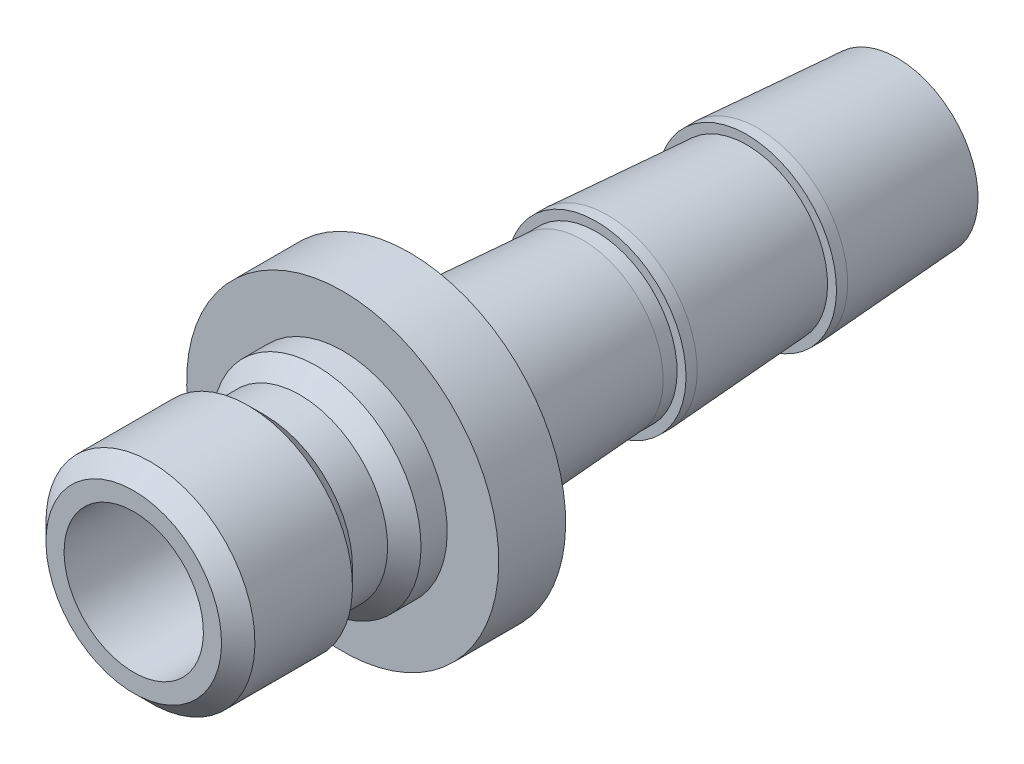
ISO-10303-21;
HEADER;
FILE_DESCRIPTION(('STEP AP214'),'2;1');
FILE_NAME('part.step','',(''),(''),'','','');
FILE_SCHEMA(('AUTOMOTIVE_DESIGN { 1 0 10303 214 1 1 1 1 }'));
ENDSEC;
DATA;
#1=APPLICATION_CONTEXT('core data for automotive mechanical design processes');
#2=APPLICATION_PROTOCOL_DEFINITION('international standard','automotive_design',2000,#1);
#3=PRODUCT_CONTEXT('',#1,'mechanical');
#4=PRODUCT('Part','Part','',(#3));
#5=PRODUCT_RELATED_PRODUCT_CATEGORY('part','',(#4));
#6=PRODUCT_DEFINITION_FORMATION('','',#4);
#7=PRODUCT_DEFINITION_CONTEXT('part definition',#1,'design');
#8=PRODUCT_DEFINITION('design','',#6,#7);
#9=PRODUCT_DEFINITION_SHAPE('','',#8);
#10=(LENGTH_UNIT() NAMED_UNIT(*) SI_UNIT(.MILLI.,.METRE.));
#11=(NAMED_UNIT(*) PLANE_ANGLE_UNIT() SI_UNIT($,.RADIAN.));
#12=(NAMED_UNIT(*) SI_UNIT($,.STERADIAN.) SOLID_ANGLE_UNIT());
#13=UNCERTAINTY_MEASURE_WITH_UNIT(LENGTH_MEASURE(1.E-05),#10,'distance_accuracy_value','');
#14=(GEOMETRIC_REPRESENTATION_CONTEXT(3) GLOBAL_UNCERTAINTY_ASSIGNED_CONTEXT((#13)) GLOBAL_UNIT_ASSIGNED_CONTEXT((#10,
#11,#12)) REPRESENTATION_CONTEXT('',''));
#15=CARTESIAN_POINT('',(0.,0.,0.));
#16=DIRECTION('',(0.,0.,1.));
#17=DIRECTION('',(1.,0.,0.));
#18=AXIS2_PLACEMENT_3D('',#15,#16,#17);
#19=CARTESIAN_POINT('',(0.,0.,0.));
#20=DIRECTION('',(0.,0.,-1.));
#21=DIRECTION('',(0.,1.,0.));
#22=AXIS2_PLACEMENT_3D('',#19,#20,#21);
#23=CYLINDRICAL_SURFACE('',#22,3.175);
#24=CARTESIAN_POINT('',(0.,0.,-25.273));
#25=DIRECTION('',(0.,0.,-1.));
#26=DIRECTION('',(0.,1.,0.));
#27=AXIS2_PLACEMENT_3D('',#24,#25,#26);
#28=CIRCLE('',#27,3.17499999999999);
#29=CARTESIAN_POINT('',(0.,3.175,-25.273));
#30=VERTEX_POINT('',#29);
#31=EDGE_CURVE('E98',#30,#30,#28,.T.);
#32=ORIENTED_EDGE('',*,*,#31,.T.);
#33=EDGE_LOOP('',(#32));
#34=FACE_BOUND('',#33,.T.);
#35=CARTESIAN_POINT('',(0.,0.,9.525));
#36=DIRECTION('',(0.,0.,-1.));
#37=DIRECTION('',(0.,1.,0.));
#38=AXIS2_PLACEMENT_3D('',#35,#36,#37);
#39=CIRCLE('',#38,3.175);
#40=CARTESIAN_POINT('',(0.,3.175,9.525));
#41=VERTEX_POINT('',#40);
#42=EDGE_CURVE('E10',#41,#41,#39,.T.);
#43=ORIENTED_EDGE('',*,*,#42,.F.);
#44=EDGE_LOOP('',(#43));
#45=FACE_BOUND('',#44,.T.);
#46=ADVANCED_FACE('F31',(#34,#45),#23,.F.);
#47=CARTESIAN_POINT('',(0.,3.175,9.525));
#48=DIRECTION('',(0.,0.,1.));
#49=DIRECTION('',(0.,-1.,0.));
#50=AXIS2_PLACEMENT_3D('',#47,#48,#49);
#51=PLANE('',#50);
#52=ORIENTED_EDGE('',*,*,#42,.T.);
#53=EDGE_LOOP('',(#52));
#54=FACE_BOUND('',#53,.T.);
#55=CARTESIAN_POINT('',(0.,0.,9.525));
#56=DIRECTION('',(0.,0.,-1.));
#57=DIRECTION('',(0.,1.,0.));
#58=AXIS2_PLACEMENT_3D('',#55,#56,#57);
#59=CIRCLE('',#58,4.0005);
#60=CARTESIAN_POINT('',(0.,4.0005,9.525));
#61=VERTEX_POINT('',#60);
#62=EDGE_CURVE('E37',#61,#61,#59,.T.);
#63=ORIENTED_EDGE('',*,*,#62,.F.);
#64=EDGE_LOOP('',(#63));
#65=FACE_BOUND('',#64,.T.);
#66=ADVANCED_FACE('F116',(#54,#65),#51,.T.);
#67=CARTESIAN_POINT('',(0.,0.,8.763));
#68=DIRECTION('',(0.,0.,-1.));
#69=DIRECTION('',(0.,1.,0.));
#70=AXIS2_PLACEMENT_3D('',#67,#68,#69);
#71=CONICAL_SURFACE('',#70,4.7625,0.785398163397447);
#72=ORIENTED_EDGE('',*,*,#62,.T.);
#73=EDGE_LOOP('',(#72));
#74=FACE_BOUND('',#73,.T.);
#75=CARTESIAN_POINT('',(0.,0.,8.763));
#76=DIRECTION('',(0.,0.,-1.));
#77=DIRECTION('',(0.,1.,0.));
#78=AXIS2_PLACEMENT_3D('',#75,#76,#77);
#79=CIRCLE('',#78,4.7625);
#80=CARTESIAN_POINT('',(0.,4.7625,8.763));
#81=VERTEX_POINT('',#80);
#82=EDGE_CURVE('E41',#81,#81,#79,.T.);
#83=ORIENTED_EDGE('',*,*,#82,.F.);
#84=EDGE_LOOP('',(#83));
#85=FACE_BOUND('',#84,.T.);
#86=ADVANCED_FACE('F120',(#74,#85),#71,.T.);
#87=CARTESIAN_POINT('',(0.,0.,0.));
#88=DIRECTION('',(0.,0.,-1.));
#89=DIRECTION('',(0.,1.,0.));
#90=AXIS2_PLACEMENT_3D('',#87,#88,#89);
#91=CYLINDRICAL_SURFACE('',#90,4.7625);
#92=ORIENTED_EDGE('',*,*,#82,.T.);
#93=EDGE_LOOP('',(#92));
#94=FACE_BOUND('',#93,.T.);
#95=CARTESIAN_POINT('',(0.,0.,4.318));
#96=DIRECTION('',(0.,0.,-1.));
#97=DIRECTION('',(0.,1.,0.));
#98=AXIS2_PLACEMENT_3D('',#95,#96,#97);
#99=CIRCLE('',#98,4.7625);
#100=CARTESIAN_POINT('',(0.,4.7625,4.318));
#101=VERTEX_POINT('',#100);
#102=EDGE_CURVE('E45',#101,#101,#99,.T.);
#103=ORIENTED_EDGE('',*,*,#102,.F.);
#104=EDGE_LOOP('',(#103));
#105=FACE_BOUND('',#104,.T.);
#106=ADVANCED_FACE('F124',(#94,#105),#91,.T.);
#107=CARTESIAN_POINT('',(0.,0.,3.556));
#108=DIRECTION('',(0.,0.,1.));
#109=DIRECTION('',(0.,-1.,0.));
#110=AXIS2_PLACEMENT_3D('',#107,#108,#109);
#111=CONICAL_SURFACE('',#110,4.0005,0.785398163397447);
#112=ORIENTED_EDGE('',*,*,#102,.T.);
#113=EDGE_LOOP('',(#112));
#114=FACE_BOUND('',#113,.T.);
#115=CARTESIAN_POINT('',(0.,0.,3.556));
#116=DIRECTION('',(0.,0.,-1.));
#117=DIRECTION('',(0.,1.,0.));
#118=AXIS2_PLACEMENT_3D('',#115,#116,#117);
#119=CIRCLE('',#118,4.0005);
#120=CARTESIAN_POINT('',(0.,4.0005,3.556));
#121=VERTEX_POINT('',#120);
#122=EDGE_CURVE('E50',#121,#121,#119,.T.);
#123=ORIENTED_EDGE('',*,*,#122,.F.);
#124=EDGE_LOOP('',(#123));
#125=FACE_BOUND('',#124,.T.);
#126=ADVANCED_FACE('F130',(#114,#125),#111,.T.);
#127=CARTESIAN_POINT('',(0.,0.,0.));
#128=DIRECTION('',(0.,0.,-1.));
#129=DIRECTION('',(0.,1.,0.));
#130=AXIS2_PLACEMENT_3D('',#127,#128,#129);
#131=CYLINDRICAL_SURFACE('',#130,4.0005);
#132=ORIENTED_EDGE('',*,*,#122,.T.);
#133=EDGE_LOOP('',(#132));
#134=FACE_BOUND('',#133,.T.);
#135=CARTESIAN_POINT('',(0.,0.,1.9558));
#136=DIRECTION('',(0.,0.,-1.));
#137=DIRECTION('',(0.,1.,0.));
#138=AXIS2_PLACEMENT_3D('',#135,#136,#137);
#139=CIRCLE('',#138,4.0005);
#140=CARTESIAN_POINT('',(0.,4.0005,1.9558));
#141=VERTEX_POINT('',#140);
#142=EDGE_CURVE('E53',#141,#141,#139,.T.);
#143=ORIENTED_EDGE('',*,*,#142,.F.);
#144=EDGE_LOOP('',(#143));
#145=FACE_BOUND('',#144,.T.);
#146=ADVANCED_FACE('F134',(#134,#145),#131,.T.);
#147=CARTESIAN_POINT('',(0.,0.,1.1938));
#148=DIRECTION('',(0.,0.,-1.));
#149=DIRECTION('',(0.,1.,0.));
#150=AXIS2_PLACEMENT_3D('',#147,#148,#149);
#151=CONICAL_SURFACE('',#150,4.7625,0.785398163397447);
#152=ORIENTED_EDGE('',*,*,#142,.T.);
#153=EDGE_LOOP('',(#152));
#154=FACE_BOUND('',#153,.T.);
#155=CARTESIAN_POINT('',(0.,0.,1.1938));
#156=DIRECTION('',(0.,0.,-1.));
#157=DIRECTION('',(0.,1.,0.));
#158=AXIS2_PLACEMENT_3D('',#155,#156,#157);
#159=CIRCLE('',#158,4.7625);
#160=CARTESIAN_POINT('',(0.,4.7625,1.1938));
#161=VERTEX_POINT('',#160);
#162=EDGE_CURVE('E56',#161,#161,#159,.T.);
#163=ORIENTED_EDGE('',*,*,#162,.F.);
#164=EDGE_LOOP('',(#163));
#165=FACE_BOUND('',#164,.T.);
#166=ADVANCED_FACE('F138',(#154,#165),#151,.T.);
#167=CARTESIAN_POINT('',(0.,0.,0.));
#168=DIRECTION('',(0.,0.,-1.));
#169=DIRECTION('',(0.,1.,0.));
#170=AXIS2_PLACEMENT_3D('',#167,#168,#169);
#171=CYLINDRICAL_SURFACE('',#170,4.7625);
#172=ORIENTED_EDGE('',*,*,#162,.T.);
#173=EDGE_LOOP('',(#172));
#174=FACE_BOUND('',#173,.T.);
#175=CARTESIAN_POINT('',(0.,0.,0.));
#176=DIRECTION('',(0.,0.,-1.));
#177=DIRECTION('',(0.,1.,0.));
#178=AXIS2_PLACEMENT_3D('',#175,#176,#177);
#179=CIRCLE('',#178,4.7625);
#180=CARTESIAN_POINT('',(0.,4.7625,0.));
#181=VERTEX_POINT('',#180);
#182=EDGE_CURVE('E59',#181,#181,#179,.T.);
#183=ORIENTED_EDGE('',*,*,#182,.F.);
#184=EDGE_LOOP('',(#183));
#185=FACE_BOUND('',#184,.T.);
#186=ADVANCED_FACE('F142',(#174,#185),#171,.T.);
#187=CARTESIAN_POINT('',(0.,4.7625,0.));
#188=DIRECTION('',(0.,0.,1.));
#189=DIRECTION('',(0.,-1.,0.));
#190=AXIS2_PLACEMENT_3D('',#187,#188,#189);
#191=PLANE('',#190);
#192=ORIENTED_EDGE('',*,*,#182,.T.);
#193=EDGE_LOOP('',(#192));
#194=FACE_BOUND('',#193,.T.);
#195=CARTESIAN_POINT('',(0.,0.,0.));
#196=DIRECTION('',(0.,0.,-1.));
#197=DIRECTION('',(0.,1.,0.));
#198=AXIS2_PLACEMENT_3D('',#195,#196,#197);
#199=CIRCLE('',#198,7.112);
#200=CARTESIAN_POINT('',(0.,7.112,0.));
#201=VERTEX_POINT('',#200);
#202=EDGE_CURVE('E62',#201,#201,#199,.T.);
#203=ORIENTED_EDGE('',*,*,#202,.F.);
#204=EDGE_LOOP('',(#203));
#205=FACE_BOUND('',#204,.T.);
#206=ADVANCED_FACE('F146',(#194,#205),#191,.T.);
#207=CARTESIAN_POINT('',(0.,0.,0.));
#208=DIRECTION('',(0.,0.,-1.));
#209=DIRECTION('',(0.,1.,0.));
#210=AXIS2_PLACEMENT_3D('',#207,#208,#209);
#211=CYLINDRICAL_SURFACE('',#210,7.112);
#212=ORIENTED_EDGE('',*,*,#202,.T.);
#213=EDGE_LOOP('',(#212));
#214=FACE_BOUND('',#213,.T.);
#215=CARTESIAN_POINT('',(0.,0.,-3.04800000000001));
#216=DIRECTION('',(0.,0.,-1.));
#217=DIRECTION('',(0.,1.,0.));
#218=AXIS2_PLACEMENT_3D('',#215,#216,#217);
#219=CIRCLE('',#218,7.112);
#220=CARTESIAN_POINT('',(0.,7.112,-3.048));
#221=VERTEX_POINT('',#220);
#222=EDGE_CURVE('E65',#221,#221,#219,.T.);
#223=ORIENTED_EDGE('',*,*,#222,.F.);
#224=EDGE_LOOP('',(#223));
#225=FACE_BOUND('',#224,.T.);
#226=ADVANCED_FACE('F150',(#214,#225),#211,.T.);
#227=CARTESIAN_POINT('',(0.,7.112,-3.048));
#228=DIRECTION('',(0.,0.,-1.));
#229=DIRECTION('',(0.,1.,0.));
#230=AXIS2_PLACEMENT_3D('',#227,#228,#229);
#231=PLANE('',#230);
#232=ORIENTED_EDGE('',*,*,#222,.T.);
#233=EDGE_LOOP('',(#232));
#234=FACE_BOUND('',#233,.T.);
#235=CARTESIAN_POINT('',(0.,0.,-3.048));
#236=DIRECTION('',(0.,0.,-1.));
#237=DIRECTION('',(0.,1.,0.));
#238=AXIS2_PLACEMENT_3D('',#235,#236,#237);
#239=CIRCLE('',#238,4.0894);
#240=CARTESIAN_POINT('',(0.,4.0894,-3.048));
#241=VERTEX_POINT('',#240);
#242=EDGE_CURVE('E68',#241,#241,#239,.T.);
#243=ORIENTED_EDGE('',*,*,#242,.F.);
#244=EDGE_LOOP('',(#243));
#245=FACE_BOUND('',#244,.T.);
#246=ADVANCED_FACE('F154',(#234,#245),#231,.T.);
#247=CARTESIAN_POINT('',(0.,0.,0.));
#248=DIRECTION('',(0.,0.,-1.));
#249=DIRECTION('',(0.,1.,0.));
#250=AXIS2_PLACEMENT_3D('',#247,#248,#249);
#251=CYLINDRICAL_SURFACE('',#250,4.0894);
#252=ORIENTED_EDGE('',*,*,#242,.T.);
#253=EDGE_LOOP('',(#252));
#254=FACE_BOUND('',#253,.T.);
#255=CARTESIAN_POINT('',(0.,0.,-4.572));
#256=DIRECTION('',(0.,0.,-1.));
#257=DIRECTION('',(0.,1.,0.));
#258=AXIS2_PLACEMENT_3D('',#255,#256,#257);
#259=CIRCLE('',#258,4.0894);
#260=CARTESIAN_POINT('',(0.,4.0894,-4.572));
#261=VERTEX_POINT('',#260);
#262=EDGE_CURVE('E71',#261,#261,#259,.T.);
#263=ORIENTED_EDGE('',*,*,#262,.F.);
#264=EDGE_LOOP('',(#263));
#265=FACE_BOUND('',#264,.T.);
#266=ADVANCED_FACE('F158',(#254,#265),#251,.T.);
#267=CARTESIAN_POINT('',(0.,0.,-10.922));
#268=DIRECTION('',(0.,0.,1.));
#269=DIRECTION('',(0.,-1.,0.));
#270=AXIS2_PLACEMENT_3D('',#267,#268,#269);
#271=CONICAL_SURFACE('',#270,3.683,0.0639128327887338);
#272=ORIENTED_EDGE('',*,*,#262,.T.);
#273=EDGE_LOOP('',(#272));
#274=FACE_BOUND('',#273,.T.);
#275=CARTESIAN_POINT('',(0.,0.,-10.922));
#276=DIRECTION('',(0.,0.,-1.));
#277=DIRECTION('',(0.,1.,0.));
#278=AXIS2_PLACEMENT_3D('',#275,#276,#277);
#279=CIRCLE('',#278,3.683);
#280=CARTESIAN_POINT('',(0.,3.683,-10.922));
#281=VERTEX_POINT('',#280);
#282=EDGE_CURVE('E74',#281,#281,#279,.T.);
#283=ORIENTED_EDGE('',*,*,#282,.F.);
#284=EDGE_LOOP('',(#283));
#285=FACE_BOUND('',#284,.T.);
#286=ADVANCED_FACE('F162',(#274,#285),#271,.T.);
#287=CARTESIAN_POINT('',(0.,0.,0.));
#288=DIRECTION('',(0.,0.,-1.));
#289=DIRECTION('',(0.,1.,0.));
#290=AXIS2_PLACEMENT_3D('',#287,#288,#289);
#291=CYLINDRICAL_SURFACE('',#290,3.683);
#292=ORIENTED_EDGE('',*,*,#282,.T.);
#293=EDGE_LOOP('',(#292));
#294=FACE_BOUND('',#293,.T.);
#295=CARTESIAN_POINT('',(0.,0.,-11.557));
#296=DIRECTION('',(0.,0.,-1.));
#297=DIRECTION('',(0.,1.,0.));
#298=AXIS2_PLACEMENT_3D('',#295,#296,#297);
#299=CIRCLE('',#298,3.683);
#300=CARTESIAN_POINT('',(0.,3.683,-11.557));
#301=VERTEX_POINT('',#300);
#302=EDGE_CURVE('E77',#301,#301,#299,.T.);
#303=ORIENTED_EDGE('',*,*,#302,.F.);
#304=EDGE_LOOP('',(#303));
#305=FACE_BOUND('',#304,.T.);
#306=ADVANCED_FACE('F166',(#294,#305),#291,.T.);
#307=CARTESIAN_POINT('',(0.,4.0894,-11.557));
#308=DIRECTION('',(0.,0.,1.));
#309=DIRECTION('',(0.,-1.,0.));
#310=AXIS2_PLACEMENT_3D('',#307,#308,#309);
#311=PLANE('',#310);
#312=ORIENTED_EDGE('',*,*,#302,.T.);
#313=EDGE_LOOP('',(#312));
#314=FACE_BOUND('',#313,.T.);
#315=CARTESIAN_POINT('',(0.,0.,-11.557));
#316=DIRECTION('',(0.,0.,-1.));
#317=DIRECTION('',(0.,1.,0.));
#318=AXIS2_PLACEMENT_3D('',#315,#316,#317);
#319=CIRCLE('',#318,4.0894);
#320=CARTESIAN_POINT('',(0.,4.0894,-11.557));
#321=VERTEX_POINT('',#320);
#322=EDGE_CURVE('E80',#321,#321,#319,.T.);
#323=ORIENTED_EDGE('',*,*,#322,.F.);
#324=EDGE_LOOP('',(#323));
#325=FACE_BOUND('',#324,.T.);
#326=ADVANCED_FACE('F170',(#314,#325),#311,.T.);
#327=CARTESIAN_POINT('',(0.,0.,0.));
#328=DIRECTION('',(0.,0.,-1.));
#329=DIRECTION('',(0.,1.,0.));
#330=AXIS2_PLACEMENT_3D('',#327,#328,#329);
#331=CYLINDRICAL_SURFACE('',#330,4.0894);
#332=ORIENTED_EDGE('',*,*,#322,.T.);
#333=EDGE_LOOP('',(#332));
#334=FACE_BOUND('',#333,.T.);
#335=CARTESIAN_POINT('',(0.,0.,-12.065));
#336=DIRECTION('',(0.,0.,-1.));
#337=DIRECTION('',(0.,1.,0.));
#338=AXIS2_PLACEMENT_3D('',#335,#336,#337);
#339=CIRCLE('',#338,4.0894);
#340=CARTESIAN_POINT('',(0.,4.0894,-12.065));
#341=VERTEX_POINT('',#340);
#342=EDGE_CURVE('E83',#341,#341,#339,.T.);
#343=ORIENTED_EDGE('',*,*,#342,.F.);
#344=EDGE_LOOP('',(#343));
#345=FACE_BOUND('',#344,.T.);
#346=ADVANCED_FACE('F174',(#334,#345),#331,.T.);
#347=CARTESIAN_POINT('',(0.,0.,-18.415));
#348=DIRECTION('',(0.,0.,1.));
#349=DIRECTION('',(0.,-1.,0.));
#350=AXIS2_PLACEMENT_3D('',#347,#348,#349);
#351=CONICAL_SURFACE('',#350,3.683,0.0639128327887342);
#352=ORIENTED_EDGE('',*,*,#342,.T.);
#353=EDGE_LOOP('',(#352));
#354=FACE_BOUND('',#353,.T.);
#355=CARTESIAN_POINT('',(0.,0.,-18.415));
#356=DIRECTION('',(0.,0.,-1.));
#357=DIRECTION('',(0.,1.,0.));
#358=AXIS2_PLACEMENT_3D('',#355,#356,#357);
#359=CIRCLE('',#358,3.683);
#360=CARTESIAN_POINT('',(0.,3.683,-18.415));
#361=VERTEX_POINT('',#360);
#362=EDGE_CURVE('E86',#361,#361,#359,.T.);
#363=ORIENTED_EDGE('',*,*,#362,.F.);
#364=EDGE_LOOP('',(#363));
#365=FACE_BOUND('',#364,.T.);
#366=ADVANCED_FACE('F178',(#354,#365),#351,.T.);
#367=CARTESIAN_POINT('',(0.,4.0894,-18.415));
#368=DIRECTION('',(0.,0.,1.));
#369=DIRECTION('',(0.,-1.,0.));
#370=AXIS2_PLACEMENT_3D('',#367,#368,#369);
#371=PLANE('',#370);
#372=ORIENTED_EDGE('',*,*,#362,.T.);
#373=EDGE_LOOP('',(#372));
#374=FACE_BOUND('',#373,.T.);
#375=CARTESIAN_POINT('',(0.,0.,-18.415));
#376=DIRECTION('',(0.,0.,-1.));
#377=DIRECTION('',(0.,1.,0.));
#378=AXIS2_PLACEMENT_3D('',#375,#376,#377);
#379=CIRCLE('',#378,4.0894);
#380=CARTESIAN_POINT('',(0.,4.0894,-18.415));
#381=VERTEX_POINT('',#380);
#382=EDGE_CURVE('E89',#381,#381,#379,.T.);
#383=ORIENTED_EDGE('',*,*,#382,.F.);
#384=EDGE_LOOP('',(#383));
#385=FACE_BOUND('',#384,.T.);
#386=ADVANCED_FACE('F182',(#374,#385),#371,.T.);
#387=CARTESIAN_POINT('',(0.,0.,0.));
#388=DIRECTION('',(0.,0.,-1.));
#389=DIRECTION('',(0.,1.,0.));
#390=AXIS2_PLACEMENT_3D('',#387,#388,#389);
#391=CYLINDRICAL_SURFACE('',#390,4.0894);
#392=ORIENTED_EDGE('',*,*,#382,.T.);
#393=EDGE_LOOP('',(#392));
#394=FACE_BOUND('',#393,.T.);
#395=CARTESIAN_POINT('',(0.,0.,-18.923));
#396=DIRECTION('',(0.,0.,-1.));
#397=DIRECTION('',(0.,1.,0.));
#398=AXIS2_PLACEMENT_3D('',#395,#396,#397);
#399=CIRCLE('',#398,4.0894);
#400=CARTESIAN_POINT('',(0.,4.0894,-18.923));
#401=VERTEX_POINT('',#400);
#402=EDGE_CURVE('E92',#401,#401,#399,.T.);
#403=ORIENTED_EDGE('',*,*,#402,.F.);
#404=EDGE_LOOP('',(#403));
#405=FACE_BOUND('',#404,.T.);
#406=ADVANCED_FACE('F112',(#394,#405),#391,.T.);
#407=CARTESIAN_POINT('',(0.,0.,-25.273));
#408=DIRECTION('',(0.,0.,1.));
#409=DIRECTION('',(0.,-1.,0.));
#410=AXIS2_PLACEMENT_3D('',#407,#408,#409);
#411=CONICAL_SURFACE('',#410,3.683,0.063912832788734);
#412=ORIENTED_EDGE('',*,*,#402,.T.);
#413=EDGE_LOOP('',(#412));
#414=FACE_BOUND('',#413,.T.);
#415=CARTESIAN_POINT('',(0.,0.,-25.273));
#416=DIRECTION('',(0.,0.,-1.));
#417=DIRECTION('',(0.,1.,0.));
#418=AXIS2_PLACEMENT_3D('',#415,#416,#417);
#419=CIRCLE('',#418,3.683);
#420=CARTESIAN_POINT('',(0.,3.683,-25.273));
#421=VERTEX_POINT('',#420);
#422=EDGE_CURVE('E95',#421,#421,#419,.T.);
#423=ORIENTED_EDGE('',*,*,#422,.F.);
#424=EDGE_LOOP('',(#423));
#425=FACE_BOUND('',#424,.T.);
#426=ADVANCED_FACE('F106',(#414,#425),#411,.T.);
#427=CARTESIAN_POINT('',(0.,3.683,-25.273));
#428=DIRECTION('',(0.,0.,-1.));
#429=DIRECTION('',(0.,1.,0.));
#430=AXIS2_PLACEMENT_3D('',#427,#428,#429);
#431=PLANE('',#430);
#432=ORIENTED_EDGE('',*,*,#422,.T.);
#433=EDGE_LOOP('',(#432));
#434=FACE_BOUND('',#433,.T.);
#435=ORIENTED_EDGE('',*,*,#31,.F.);
#436=EDGE_LOOP('',(#435));
#437=FACE_BOUND('',#436,.T.);
#438=ADVANCED_FACE('F104',(#434,#437),#431,.T.);
#439=CLOSED_SHELL('',(#46,#66,#86,#106,#126,#146,#166,#186,#206,#226,#246,#266,#286,#306,#326,
#346,#366,#386,#406,#426,#438));
#440=MANIFOLD_SOLID_BREP('B2',#439);
#441=ADVANCED_BREP_SHAPE_REPRESENTATION('',(#18,#440),#14);
#442=SHAPE_DEFINITION_REPRESENTATION(#9,#441);
ENDSEC;
END-ISO-10303-21;
